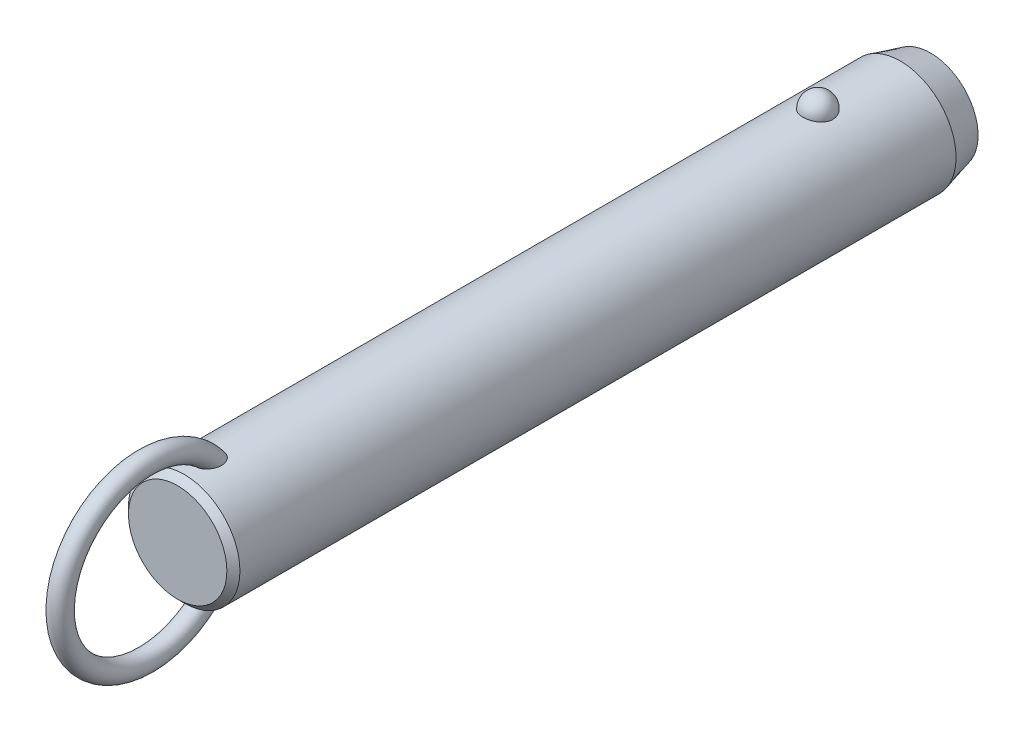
ISO-10303-21;
HEADER;
FILE_DESCRIPTION(('STEP AP214'),'2;1');
FILE_NAME('part.step','',(''),(''),'','','');
FILE_SCHEMA(('AUTOMOTIVE_DESIGN { 1 0 10303 214 1 1 1 1 }'));
ENDSEC;
DATA;
#1=APPLICATION_CONTEXT('core data for automotive mechanical design processes');
#2=APPLICATION_PROTOCOL_DEFINITION('international standard','automotive_design',2000,#1);
#3=PRODUCT_CONTEXT('',#1,'mechanical');
#4=PRODUCT('Part','Part','',(#3));
#5=PRODUCT_RELATED_PRODUCT_CATEGORY('part','',(#4));
#6=PRODUCT_DEFINITION_FORMATION('','',#4);
#7=PRODUCT_DEFINITION_CONTEXT('part definition',#1,'design');
#8=PRODUCT_DEFINITION('design','',#6,#7);
#9=PRODUCT_DEFINITION_SHAPE('','',#8);
#10=(LENGTH_UNIT() NAMED_UNIT(*) SI_UNIT(.MILLI.,.METRE.));
#11=(NAMED_UNIT(*) PLANE_ANGLE_UNIT() SI_UNIT($,.RADIAN.));
#12=(NAMED_UNIT(*) SI_UNIT($,.STERADIAN.) SOLID_ANGLE_UNIT());
#13=UNCERTAINTY_MEASURE_WITH_UNIT(LENGTH_MEASURE(1.E-05),#10,'distance_accuracy_value','');
#14=(GEOMETRIC_REPRESENTATION_CONTEXT(3) GLOBAL_UNCERTAINTY_ASSIGNED_CONTEXT((#13)) GLOBAL_UNIT_ASSIGNED_CONTEXT((#10,
#11,#12)) REPRESENTATION_CONTEXT('',''));
#15=CARTESIAN_POINT('',(0.,0.,0.));
#16=DIRECTION('',(0.,0.,1.));
#17=DIRECTION('',(1.,0.,0.));
#18=AXIS2_PLACEMENT_3D('',#15,#16,#17);
#19=CARTESIAN_POINT('',(0.,0.,111.8));
#20=DIRECTION('',(0.,0.,-1.));
#21=DIRECTION('',(-1.,0.,0.));
#22=AXIS2_PLACEMENT_3D('',#19,#20,#21);
#23=CYLINDRICAL_SURFACE('',#22,11.1);
#24=CARTESIAN_POINT('',(2.9724815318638,10.6945945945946,-3.));
#25=CARTESIAN_POINT('',(2.97247830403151,10.6945972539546,-2.83225059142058));
#26=CARTESIAN_POINT('',(2.95876598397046,10.6984356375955,-2.66445972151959));
#27=CARTESIAN_POINT('',(2.90424529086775,10.7133624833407,-2.33362381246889));
#28=CARTESIAN_POINT('',(2.8634252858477,10.7244540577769,-2.1705808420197));
#29=CARTESIAN_POINT('',(2.75573657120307,10.7526272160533,-1.85396767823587));
#30=CARTESIAN_POINT('',(2.68887937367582,10.7697061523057,-1.70039333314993));
#31=CARTESIAN_POINT('',(2.53079696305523,10.8079438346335,-1.40691598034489));
#32=CARTESIAN_POINT('',(2.43957264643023,10.8291024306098,-1.2670124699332));
#33=CARTESIAN_POINT('',(2.23458150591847,10.8732541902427,-1.00409565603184));
#34=CARTESIAN_POINT('',(2.12071295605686,10.8962553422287,-0.881162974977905));
#35=CARTESIAN_POINT('',(1.87365402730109,10.9414421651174,-0.656352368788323));
#36=CARTESIAN_POINT('',(1.74046358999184,10.9636278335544,-0.554474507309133));
#37=CARTESIAN_POINT('',(1.45872188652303,11.0046495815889,-0.374872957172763));
#38=CARTESIAN_POINT('',(1.31021276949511,11.0234944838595,-0.297085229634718));
#39=CARTESIAN_POINT('',(1.00170030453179,11.0557957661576,-0.167529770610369));
#40=CARTESIAN_POINT('',(0.841698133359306,11.0692526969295,-0.115759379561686));
#41=CARTESIAN_POINT('',(0.517607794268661,11.0890932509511,-0.0403925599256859));
#42=CARTESIAN_POINT('',(0.353633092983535,11.0955916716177,-0.0163383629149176));
#43=CARTESIAN_POINT('',(0.0238420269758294,11.1011989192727,0.0044517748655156));
#44=CARTESIAN_POINT('',(-0.141974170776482,11.1003084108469,0.00119017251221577));
#45=CARTESIAN_POINT('',(-0.468405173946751,11.0912990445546,-0.0323233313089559));
#46=CARTESIAN_POINT('',(-0.629059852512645,11.0832767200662,-0.0622147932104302));
#47=CARTESIAN_POINT('',(-0.942937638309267,11.0609962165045,-0.147645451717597));
#48=CARTESIAN_POINT('',(-1.09616062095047,11.0467379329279,-0.203185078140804));
#49=CARTESIAN_POINT('',(-1.39181061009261,11.0134071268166,-0.3387529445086));
#50=CARTESIAN_POINT('',(-1.53417383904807,10.9943086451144,-0.418913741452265));
#51=CARTESIAN_POINT('',(-1.80342160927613,10.9533667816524,-0.60144882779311));
#52=CARTESIAN_POINT('',(-1.9303046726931,10.9315231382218,-0.703825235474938));
#53=CARTESIAN_POINT('',(-2.16747598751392,10.887005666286,-0.930091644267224));
#54=CARTESIAN_POINT('',(-2.27742774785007,10.8643239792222,-1.05433291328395));
#55=CARTESIAN_POINT('',(-2.47517316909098,10.8209886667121,-1.31966633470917));
#56=CARTESIAN_POINT('',(-2.56296538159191,10.8003351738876,-1.46075958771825));
#57=CARTESIAN_POINT('',(-2.71500300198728,10.7631304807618,-1.75753646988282));
#58=CARTESIAN_POINT('',(-2.77898901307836,10.7466250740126,-1.91335887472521));
#59=CARTESIAN_POINT('',(-2.88046189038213,10.7198747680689,-2.2339152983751));
#60=CARTESIAN_POINT('',(-2.91794947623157,10.709629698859,-2.39864907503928));
#61=CARTESIAN_POINT('',(-2.96537819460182,10.6965949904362,-2.73165170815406));
#62=CARTESIAN_POINT('',(-2.97542891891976,10.693775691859,-2.89990378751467));
#63=CARTESIAN_POINT('',(-2.96804271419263,10.6958279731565,-3.235752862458));
#64=CARTESIAN_POINT('',(-2.95060646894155,10.7006993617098,-3.40334987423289));
#65=CARTESIAN_POINT('',(-2.88883358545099,10.71753912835,-3.73233906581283));
#66=CARTESIAN_POINT('',(-2.84462026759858,10.7294749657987,-3.89375610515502));
#67=CARTESIAN_POINT('',(-2.73050447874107,10.7590797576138,-4.20667949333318));
#68=CARTESIAN_POINT('',(-2.66060103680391,10.7767489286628,-4.35818546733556));
#69=CARTESIAN_POINT('',(-2.49642559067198,10.8159599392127,-4.6478542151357));
#70=CARTESIAN_POINT('',(-2.40203047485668,10.8375211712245,-4.78594458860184));
#71=CARTESIAN_POINT('',(-2.19143488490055,10.8820570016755,-5.0441038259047));
#72=CARTESIAN_POINT('',(-2.07523364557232,10.9050316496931,-5.16417205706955));
#73=CARTESIAN_POINT('',(-1.82361254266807,10.9499219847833,-5.38334833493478));
#74=CARTESIAN_POINT('',(-1.68812945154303,10.9718338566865,-5.48238464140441));
#75=CARTESIAN_POINT('',(-1.40191298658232,11.0120611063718,-5.65618873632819));
#76=CARTESIAN_POINT('',(-1.25118062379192,11.0303767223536,-5.73095813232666));
#77=CARTESIAN_POINT('',(-0.940570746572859,11.0611653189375,-5.85334725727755));
#78=CARTESIAN_POINT('',(-0.780821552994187,11.0737044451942,-5.90127578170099));
#79=CARTESIAN_POINT('',(-0.455204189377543,11.0918598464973,-5.96992976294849));
#80=CARTESIAN_POINT('',(-0.289336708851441,11.0974768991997,-5.99065827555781));
#81=CARTESIAN_POINT('',(0.0406846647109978,11.1011307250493,-6.00418773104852));
#82=CARTESIAN_POINT('',(0.204817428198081,11.099299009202,-5.99747318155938));
#83=CARTESIAN_POINT('',(0.5295530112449,11.088551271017,-5.9574031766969));
#84=CARTESIAN_POINT('',(0.69015594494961,11.0796354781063,-5.92404858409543));
#85=CARTESIAN_POINT('',(1.0027760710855,11.0557204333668,-5.83180084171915));
#86=CARTESIAN_POINT('',(1.15482001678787,11.0407414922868,-5.77299291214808));
#87=CARTESIAN_POINT('',(1.44678373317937,11.0062913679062,-5.63147366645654));
#88=CARTESIAN_POINT('',(1.58670279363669,10.9868199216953,-5.54876095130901));
#89=CARTESIAN_POINT('',(1.8527023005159,10.9451315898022,-5.36027644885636));
#90=CARTESIAN_POINT('',(1.97855158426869,10.9228788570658,-5.25418644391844));
#91=CARTESIAN_POINT('',(2.21080872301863,10.8782509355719,-5.02251354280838));
#92=CARTESIAN_POINT('',(2.31721312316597,10.8558757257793,-4.89692718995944));
#93=CARTESIAN_POINT('',(2.5094551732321,10.8130715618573,-4.62745408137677));
#94=CARTESIAN_POINT('',(2.59493284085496,10.7926798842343,-4.48330448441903));
#95=CARTESIAN_POINT('',(2.740862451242,10.7565495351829,-4.18236358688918));
#96=CARTESIAN_POINT('',(2.80132490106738,10.7408089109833,-4.02557762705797));
#97=CARTESIAN_POINT('',(2.88959070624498,10.7173718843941,-3.72475308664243));
#98=CARTESIAN_POINT('',(2.92062102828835,10.7088950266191,-3.58171216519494));
#99=CARTESIAN_POINT('',(2.96206765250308,10.6975052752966,-3.29245795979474));
#100=CARTESIAN_POINT('',(2.97248434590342,10.6945922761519,-3.14624473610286));
#101=CARTESIAN_POINT('',(2.9724815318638,10.6945945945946,-3.));
#102=B_SPLINE_CURVE_WITH_KNOTS('',3,(#24,#25,#26,#27,#28,#29,#30,#31,#32,#33,#34,#35,#36,#37,
#38,#39,#40,#41,#42,#43,#44,#45,#46,#47,#48,#49,#50,#51,#52,#53,#54,#55,#56,#57,#58,#59,#60,#61,
#62,#63,#64,#65,#66,#67,#68,#69,#70,#71,#72,#73,#74,#75,#76,#77,#78,#79,#80,#81,#82,#83,#84,#85,
#86,#87,#88,#89,#90,#91,#92,#93,#94,#95,#96,#97,#98,#99,#100,#101),.UNSPECIFIED.,.T.,.F.,(4,2,2,
2,2,2,2,2,2,2,2,2,2,2,2,2,2,2,2,2,2,2,2,2,2,2,2,2,2,2,2,2,2,2,2,2,2,2,4),(0.,0.502722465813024,
1.00566079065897,1.5083769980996,2.01107471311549,2.51608392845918,3.02109467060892,
3.52475118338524,4.02835620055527,4.523518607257,5.0186364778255,5.50715297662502,
5.9956776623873,6.48688002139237,6.97812923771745,7.47814366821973,7.9781907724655,
8.48353712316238,8.9888697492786,9.49218093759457,9.99547960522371,10.4964777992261,
10.997494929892,11.5010810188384,12.0046847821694,12.5099796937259,13.0152411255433,
13.5145635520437,14.0138298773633,14.5043200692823,14.9947943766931,15.4836390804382,
15.9725123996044,16.4685040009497,16.9645836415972,17.4686765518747,17.972557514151,
18.410841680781,18.849117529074),.UNSPECIFIED.);
#103=CARTESIAN_POINT('',(2.9724815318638,10.6945945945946,-3.));
#104=VERTEX_POINT('',#103);
#105=EDGE_CURVE('E41',#104,#104,#102,.T.);
#106=ORIENTED_EDGE('',*,*,#105,.T.);
#107=EDGE_LOOP('',(#106));
#108=FACE_BOUND('',#107,.T.);
#109=CARTESIAN_POINT('',(0.,0.,123.2));
#110=DIRECTION('',(0.,0.,1.));
#111=DIRECTION('',(1.,0.,0.));
#112=AXIS2_PLACEMENT_3D('',#109,#110,#111);
#113=CIRCLE('',#112,11.1);
#114=CARTESIAN_POINT('',(11.1,0.,123.2));
#115=VERTEX_POINT('',#114);
#116=EDGE_CURVE('E10',#115,#115,#113,.F.);
#117=ORIENTED_EDGE('',*,*,#116,.T.);
#118=EDGE_LOOP('',(#117));
#119=FACE_BOUND('',#118,.T.);
#120=CARTESIAN_POINT('',(-0.564520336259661,-11.0856356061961,115.457815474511));
#121=CARTESIAN_POINT('',(-0.667202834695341,-11.0804062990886,115.491283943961));
#122=CARTESIAN_POINT('',(-0.766875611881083,-11.0738877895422,115.533835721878));
#123=CARTESIAN_POINT('',(-0.957284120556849,-11.0590576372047,115.635419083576));
#124=CARTESIAN_POINT('',(-1.04801616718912,-11.0507452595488,115.69445742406));
#125=CARTESIAN_POINT('',(-1.21800952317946,-11.0333016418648,115.826529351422));
#126=CARTESIAN_POINT('',(-1.29730805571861,-11.0241732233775,115.899515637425));
#127=CARTESIAN_POINT('',(-1.44337665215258,-11.0060026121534,116.057037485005));
#128=CARTESIAN_POINT('',(-1.51014622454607,-10.9969604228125,116.141573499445));
#129=CARTESIAN_POINT('',(-1.63454620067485,-10.9791841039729,116.325521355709));
#130=CARTESIAN_POINT('',(-1.69127003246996,-10.9705107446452,116.425549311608));
#131=CARTESIAN_POINT('',(-1.78980785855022,-10.9548648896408,116.632790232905));
#132=CARTESIAN_POINT('',(-1.83161214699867,-10.9478935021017,116.740007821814));
#133=CARTESIAN_POINT('',(-1.91557028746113,-10.9335803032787,117.005408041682));
#134=CARTESIAN_POINT('',(-1.95040620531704,-10.9273269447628,117.165980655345));
#135=CARTESIAN_POINT('',(-1.99388326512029,-10.9194709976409,117.490697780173));
#136=CARTESIAN_POINT('',(-2.00248051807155,-10.9178762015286,117.654847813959));
#137=CARTESIAN_POINT('',(-1.99551615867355,-10.9191578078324,118.024650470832));
#138=CARTESIAN_POINT('',(-1.9732206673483,-10.9232807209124,118.230191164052));
#139=CARTESIAN_POINT('',(-1.9152976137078,-10.9335244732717,118.533595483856));
#140=CARTESIAN_POINT('',(-1.8918457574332,-10.9376266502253,118.634088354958));
#141=CARTESIAN_POINT('',(-1.83700674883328,-10.9469720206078,118.832855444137));
#142=CARTESIAN_POINT('',(-1.80562070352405,-10.9522150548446,118.931129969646));
#143=CARTESIAN_POINT('',(-1.73463055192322,-10.9636837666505,119.125914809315));
#144=CARTESIAN_POINT('',(-1.6949341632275,-10.9699202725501,119.222390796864));
#145=CARTESIAN_POINT('',(-1.6074514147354,-10.9830806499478,119.411626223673));
#146=CARTESIAN_POINT('',(-1.55966150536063,-10.9900048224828,119.504384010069));
#147=CARTESIAN_POINT('',(-1.45591812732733,-11.0042280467,119.684690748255));
#148=CARTESIAN_POINT('',(-1.40000013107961,-11.0115253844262,119.772260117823));
#149=CARTESIAN_POINT('',(-1.27937470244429,-11.0261911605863,119.941029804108));
#150=CARTESIAN_POINT('',(-1.2146783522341,-11.0335594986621,120.02223795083));
#151=CARTESIAN_POINT('',(-1.08218150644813,-11.0473027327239,120.169001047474));
#152=CARTESIAN_POINT('',(-1.0152263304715,-11.0537063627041,120.235309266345));
#153=CARTESIAN_POINT('',(-0.872952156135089,-11.065850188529,120.358378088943));
#154=CARTESIAN_POINT('',(-0.797642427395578,-11.0715911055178,120.415149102));
#155=CARTESIAN_POINT('',(-0.651396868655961,-11.081071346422,120.507515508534));
#156=CARTESIAN_POINT('',(-0.581712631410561,-11.0849841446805,120.545049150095));
#157=CARTESIAN_POINT('',(-0.437066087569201,-11.0916271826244,120.608259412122));
#158=CARTESIAN_POINT('',(-0.362109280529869,-11.0943586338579,120.633948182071));
#159=CARTESIAN_POINT('',(-0.207828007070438,-11.0983242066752,120.671117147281));
#160=CARTESIAN_POINT('',(-0.128467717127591,-11.0995432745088,120.682454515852));
#161=CARTESIAN_POINT('',(0.0309101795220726,-11.1002423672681,120.688965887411));
#162=CARTESIAN_POINT('',(0.110927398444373,-11.0997233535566,120.684148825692));
#163=CARTESIAN_POINT('',(0.256406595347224,-11.097240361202,120.660959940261));
#164=CARTESIAN_POINT('',(0.322235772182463,-11.0955074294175,120.644754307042));
#165=CARTESIAN_POINT('',(0.450635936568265,-11.0910350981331,120.602600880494));
#166=CARTESIAN_POINT('',(0.513205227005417,-11.0882951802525,120.576648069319));
#167=CARTESIAN_POINT('',(0.6626263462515,-11.0805620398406,120.502607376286));
#168=CARTESIAN_POINT('',(0.74712753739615,-11.0751144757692,120.449845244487));
#169=CARTESIAN_POINT('',(0.906756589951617,-11.0631932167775,120.331720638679));
#170=CARTESIAN_POINT('',(0.981859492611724,-11.0567168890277,120.266325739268));
#171=CARTESIAN_POINT('',(1.10712207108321,-11.0447856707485,120.14226337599));
#172=CARTESIAN_POINT('',(1.15909566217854,-11.0394280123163,120.085383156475));
#173=CARTESIAN_POINT('',(1.25791923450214,-11.0286040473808,119.967327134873));
#174=CARTESIAN_POINT('',(1.30476642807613,-11.0231376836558,119.906149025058));
#175=CARTESIAN_POINT('',(1.43818612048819,-11.0068027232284,119.717305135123));
#176=CARTESIAN_POINT('',(1.51751767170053,-10.9960104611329,119.584453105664));
#177=CARTESIAN_POINT('',(1.63597546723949,-10.9788847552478,119.353137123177));
#178=CARTESIAN_POINT('',(1.67988876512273,-10.9722190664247,119.257053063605));
#179=CARTESIAN_POINT('',(1.75953241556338,-10.9597298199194,119.061431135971));
#180=CARTESIAN_POINT('',(1.79525967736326,-10.9539065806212,118.961891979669));
#181=CARTESIAN_POINT('',(1.85844731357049,-10.9433632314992,118.76021118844));
#182=CARTESIAN_POINT('',(1.88591073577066,-10.9386427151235,118.658070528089));
#183=CARTESIAN_POINT('',(1.93234324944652,-10.9305350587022,118.451819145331));
#184=CARTESIAN_POINT('',(1.95131065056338,-10.9271481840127,118.347708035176));
#185=CARTESIAN_POINT('',(1.99040203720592,-10.9201183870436,118.065458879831));
#186=CARTESIAN_POINT('',(2.00221217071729,-10.9179256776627,117.886037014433));
#187=CARTESIAN_POINT('',(1.99711676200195,-10.9188636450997,117.527713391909));
#188=CARTESIAN_POINT('',(1.98026150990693,-10.9219849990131,117.348811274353));
#189=CARTESIAN_POINT('',(1.92151657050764,-10.9324473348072,117.03645144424));
#190=CARTESIAN_POINT('',(1.88605081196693,-10.9386915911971,116.901759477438));
#191=CARTESIAN_POINT('',(1.79393020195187,-10.9541780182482,116.639966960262));
#192=CARTESIAN_POINT('',(1.73729868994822,-10.9634168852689,116.512858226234));
#193=CARTESIAN_POINT('',(1.61237037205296,-10.9824218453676,116.289418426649));
#194=CARTESIAN_POINT('',(1.54715374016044,-10.9918945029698,116.191345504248));
#195=CARTESIAN_POINT('',(1.40127026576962,-11.0114415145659,116.007434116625));
#196=CARTESIAN_POINT('',(1.3206074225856,-11.0215157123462,115.921592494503));
#197=CARTESIAN_POINT('',(1.14474787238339,-11.041168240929,115.765163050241));
#198=CARTESIAN_POINT('',(1.04947805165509,-11.0507437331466,115.694656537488));
#199=CARTESIAN_POINT('',(0.847278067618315,-11.0680789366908,115.572640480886));
#200=CARTESIAN_POINT('',(0.740351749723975,-11.0758392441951,115.521124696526));
#201=CARTESIAN_POINT('',(0.529289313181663,-11.0878275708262,115.443485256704));
#202=CARTESIAN_POINT('',(0.425895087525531,-11.0923259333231,115.415377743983));
#203=CARTESIAN_POINT('',(0.215723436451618,-11.0984001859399,115.377703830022));
#204=CARTESIAN_POINT('',(0.108947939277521,-11.0999777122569,115.368127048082));
#205=CARTESIAN_POINT('',(-0.0938962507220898,-11.1000196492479,115.367877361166));
#206=CARTESIAN_POINT('',(-0.189967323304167,-11.0987797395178,115.375408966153));
#207=CARTESIAN_POINT('',(-0.379657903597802,-11.0939111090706,115.405507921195));
#208=CARTESIAN_POINT('',(-0.473277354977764,-11.0902823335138,115.428075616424));
#209=CARTESIAN_POINT('',(-0.564520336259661,-11.0856356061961,115.457815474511));
#210=B_SPLINE_CURVE_WITH_KNOTS('',3,(#120,#121,#122,#123,#124,#125,#126,#127,#128,#129,#130,
#131,#132,#133,#134,#135,#136,#137,#138,#139,#140,#141,#142,#143,#144,#145,#146,#147,#148,#149,
#150,#151,#152,#153,#154,#155,#156,#157,#158,#159,#160,#161,#162,#163,#164,#165,#166,#167,#168,
#169,#170,#171,#172,#173,#174,#175,#176,#177,#178,#179,#180,#181,#182,#183,#184,#185,#186,#187,
#188,#189,#190,#191,#192,#193,#194,#195,#196,#197,#198,#199,#200,#201,#202,#203,#204,#205,#206,
#207,#208,#209),.UNSPECIFIED.,.T.,.F.,(4,2,2,2,2,2,2,2,2,2,2,2,2,2,2,2,2,2,2,2,2,2,2,2,2,2,2,2,
2,2,2,2,2,2,2,2,2,2,2,2,2,2,2,2,4),(0.,0.323999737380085,0.648132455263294,0.971184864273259,
1.2942499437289,1.6388623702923,1.98369857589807,2.47426059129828,2.96564271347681,
3.58257396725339,3.89215258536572,4.201688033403,4.51486273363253,4.82817514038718,
5.14015911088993,5.45175282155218,5.73442856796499,6.01679375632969,6.25364580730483,
6.49025437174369,6.72919963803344,6.96801276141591,7.17061258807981,7.37331685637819,
7.67094989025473,7.9693572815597,8.2007506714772,8.43226927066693,8.89581623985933,
9.21306533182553,9.5304340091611,9.84768549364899,10.1650000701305,10.7022930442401,
11.2386443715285,11.6553390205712,12.0715755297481,12.4245637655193,12.7774607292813,
13.1321855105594,13.4867936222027,13.8068771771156,14.1267813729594,14.4146787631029,
14.7025827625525),.UNSPECIFIED.);
#211=CARTESIAN_POINT('',(-0.564520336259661,-11.0856356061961,115.457815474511));
#212=VERTEX_POINT('',#211);
#213=EDGE_CURVE('E59',#212,#212,#210,.T.);
#214=ORIENTED_EDGE('',*,*,#213,.T.);
#215=EDGE_LOOP('',(#214));
#216=FACE_BOUND('',#215,.T.);
#217=CARTESIAN_POINT('',(-0.564520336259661,11.0856356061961,115.457815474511));
#218=CARTESIAN_POINT('',(-0.468542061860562,11.0905203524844,115.426545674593));
#219=CARTESIAN_POINT('',(-0.36979381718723,11.0942886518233,115.403157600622));
#220=CARTESIAN_POINT('',(-0.169555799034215,11.0991586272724,115.373085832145));
#221=CARTESIAN_POINT('',(-0.0680604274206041,11.1002543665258,115.36643932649));
#222=CARTESIAN_POINT('',(0.134549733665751,11.099646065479,115.370157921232));
#223=CARTESIAN_POINT('',(0.235664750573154,11.0979441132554,115.38051033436));
#224=CARTESIAN_POINT('',(0.434632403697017,11.0919342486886,115.417831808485));
#225=CARTESIAN_POINT('',(0.532486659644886,11.0876276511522,115.444792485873));
#226=CARTESIAN_POINT('',(0.722445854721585,11.0768742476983,115.5144096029));
#227=CARTESIAN_POINT('',(0.814543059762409,11.0704246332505,115.557086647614));
#228=CARTESIAN_POINT('',(0.99056508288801,11.0560659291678,115.656648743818));
#229=CARTESIAN_POINT('',(1.07448844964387,11.048156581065,115.713536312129));
#230=CARTESIAN_POINT('',(1.23562672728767,11.0313221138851,115.842210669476));
#231=CARTESIAN_POINT('',(1.3124268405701,11.0223686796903,115.914511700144));
#232=CARTESIAN_POINT('',(1.45398030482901,11.0045918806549,116.070042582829));
#233=CARTESIAN_POINT('',(1.5187307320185,10.9957685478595,116.153275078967));
#234=CARTESIAN_POINT('',(1.64107232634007,10.9782087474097,116.336384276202));
#235=CARTESIAN_POINT('',(1.69743176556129,10.9695572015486,116.437089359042));
#236=CARTESIAN_POINT('',(1.79515063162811,10.9539887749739,116.645626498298));
#237=CARTESIAN_POINT('',(1.83649966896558,10.9470730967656,116.75346343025));
#238=CARTESIAN_POINT('',(1.91931148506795,10.9329211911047,117.020399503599));
#239=CARTESIAN_POINT('',(1.95340104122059,10.9267904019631,117.181861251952));
#240=CARTESIAN_POINT('',(1.99526195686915,10.9192174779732,117.50821631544));
#241=CARTESIAN_POINT('',(2.00298989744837,10.9177830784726,117.67311484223));
#242=CARTESIAN_POINT('',(1.9939625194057,10.9194420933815,118.044100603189));
#243=CARTESIAN_POINT('',(1.97050829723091,10.923774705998,118.25003871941));
#244=CARTESIAN_POINT('',(1.91079643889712,10.9343131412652,118.553901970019));
#245=CARTESIAN_POINT('',(1.88673702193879,10.9385106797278,118.654529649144));
#246=CARTESIAN_POINT('',(1.83065508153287,10.9480376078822,118.853510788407));
#247=CARTESIAN_POINT('',(1.79863369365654,10.9533668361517,118.951864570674));
#248=CARTESIAN_POINT('',(1.72633365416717,10.9649954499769,119.146720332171));
#249=CARTESIAN_POINT('',(1.68596409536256,10.9713053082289,119.24318790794));
#250=CARTESIAN_POINT('',(1.5970799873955,10.9845964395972,119.432323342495));
#251=CARTESIAN_POINT('',(1.54856169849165,10.9915780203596,119.524989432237));
#252=CARTESIAN_POINT('',(1.44330168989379,11.0058935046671,119.704975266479));
#253=CARTESIAN_POINT('',(1.38659749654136,11.0132257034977,119.792316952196));
#254=CARTESIAN_POINT('',(1.26431158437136,11.0279330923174,119.960456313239));
#255=CARTESIAN_POINT('',(1.19874160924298,11.0353082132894,120.041262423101));
#256=CARTESIAN_POINT('',(1.06542088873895,11.048931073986,120.185985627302));
#257=CARTESIAN_POINT('',(0.998640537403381,11.0552153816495,120.250784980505));
#258=CARTESIAN_POINT('',(0.856896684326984,11.0671032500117,120.370846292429));
#259=CARTESIAN_POINT('',(0.781942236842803,11.0727075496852,120.426118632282));
#260=CARTESIAN_POINT('',(0.636276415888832,11.081949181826,120.515972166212));
#261=CARTESIAN_POINT('',(0.566755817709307,11.0857572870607,120.552441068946));
#262=CARTESIAN_POINT('',(0.422602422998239,11.0921860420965,120.613533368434));
#263=CARTESIAN_POINT('',(0.347974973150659,11.0948079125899,120.638168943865));
#264=CARTESIAN_POINT('',(0.19459385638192,11.0985608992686,120.673323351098));
#265=CARTESIAN_POINT('',(0.115807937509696,11.0996777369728,120.683706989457));
#266=CARTESIAN_POINT('',(-0.0422499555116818,11.1002003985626,120.688574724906));
#267=CARTESIAN_POINT('',(-0.121521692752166,11.09960699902,120.683066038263));
#268=CARTESIAN_POINT('',(-0.266046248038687,11.0970123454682,120.658827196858));
#269=CARTESIAN_POINT('',(-0.331661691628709,11.0952283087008,120.642135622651));
#270=CARTESIAN_POINT('',(-0.459588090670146,11.0906663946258,120.599111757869));
#271=CARTESIAN_POINT('',(-0.521897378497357,11.0878880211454,120.572774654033));
#272=CARTESIAN_POINT('',(-0.671446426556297,11.0800342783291,120.497513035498));
#273=CARTESIAN_POINT('',(-0.756250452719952,11.0744969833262,120.443818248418));
#274=CARTESIAN_POINT('',(-0.916349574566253,11.0624045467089,120.323802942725));
#275=CARTESIAN_POINT('',(-0.991618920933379,11.0558467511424,120.257449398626));
#276=CARTESIAN_POINT('',(-1.11713140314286,11.0437783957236,120.131633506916));
#277=CARTESIAN_POINT('',(-1.16920539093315,11.0383619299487,120.073952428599));
#278=CARTESIAN_POINT('',(-1.26817476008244,11.02743010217,119.954280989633));
#279=CARTESIAN_POINT('',(-1.31506731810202,11.0219146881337,119.892288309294));
#280=CARTESIAN_POINT('',(-1.40399813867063,11.0109399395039,119.764784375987));
#281=CARTESIAN_POINT('',(-1.4460286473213,11.0054807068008,119.699267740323));
#282=CARTESIAN_POINT('',(-1.52538779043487,10.9947621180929,119.565422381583));
#283=CARTESIAN_POINT('',(-1.56271516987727,10.9895028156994,119.497092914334));
#284=CARTESIAN_POINT('',(-1.64537943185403,10.9774790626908,119.333210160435));
#285=CARTESIAN_POINT('',(-1.68879497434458,10.9708503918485,119.2366735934));
#286=CARTESIAN_POINT('',(-1.76740738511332,10.9584602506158,119.040236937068));
#287=CARTESIAN_POINT('',(-1.80260120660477,10.95269910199,118.94033561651));
#288=CARTESIAN_POINT('',(-1.86468657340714,10.9423003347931,118.737966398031));
#289=CARTESIAN_POINT('',(-1.89158164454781,10.9376622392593,118.635499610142));
#290=CARTESIAN_POINT('',(-1.93682458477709,10.9297405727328,118.428642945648));
#291=CARTESIAN_POINT('',(-1.9551708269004,10.9264572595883,118.324252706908));
#292=CARTESIAN_POINT('',(-1.99232562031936,10.9197647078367,118.04262876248));
#293=CARTESIAN_POINT('',(-2.00294603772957,10.9177914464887,117.864185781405));
#294=CARTESIAN_POINT('',(-1.99566675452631,10.9191290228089,117.507996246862));
#295=CARTESIAN_POINT('',(-1.97781651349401,10.9224306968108,117.33024902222));
#296=CARTESIAN_POINT('',(-1.91747214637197,10.93315926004,117.019792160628));
#297=CARTESIAN_POINT('',(-1.88131022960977,10.9395108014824,116.885825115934));
#298=CARTESIAN_POINT('',(-1.7879038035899,10.9551659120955,116.62559757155));
#299=CARTESIAN_POINT('',(-1.73068309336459,10.9644661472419,116.499328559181));
#300=CARTESIAN_POINT('',(-1.60475573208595,10.9835398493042,116.27741565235));
#301=CARTESIAN_POINT('',(-1.53908879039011,10.9930297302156,116.180026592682));
#302=CARTESIAN_POINT('',(-1.39238608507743,11.0125708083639,115.997525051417));
#303=CARTESIAN_POINT('',(-1.31135150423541,11.0226219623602,115.912411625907));
#304=CARTESIAN_POINT('',(-1.14382035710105,11.0411991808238,115.76529943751));
#305=CARTESIAN_POINT('',(-1.05858500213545,11.0497792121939,115.70186930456));
#306=CARTESIAN_POINT('',(-0.878723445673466,11.0655285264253,115.590250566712));
#307=CARTESIAN_POINT('',(-0.784123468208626,11.0727015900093,115.542020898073));
#308=CARTESIAN_POINT('',(-0.646163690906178,11.0812501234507,115.486023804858));
#309=CARTESIAN_POINT('',(-0.605595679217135,11.0835451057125,115.471197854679));
#310=CARTESIAN_POINT('',(-0.564520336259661,11.0856356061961,115.457815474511));
#311=B_SPLINE_CURVE_WITH_KNOTS('',3,(#217,#218,#219,#220,#221,#222,#223,#224,#225,#226,#227,
#228,#229,#230,#231,#232,#233,#234,#235,#236,#237,#238,#239,#240,#241,#242,#243,#244,#245,#246,
#247,#248,#249,#250,#251,#252,#253,#254,#255,#256,#257,#258,#259,#260,#261,#262,#263,#264,#265,
#266,#267,#268,#269,#270,#271,#272,#273,#274,#275,#276,#277,#278,#279,#280,#281,#282,#283,#284,
#285,#286,#287,#288,#289,#290,#291,#292,#293,#294,#295,#296,#297,#298,#299,#300,#301,#302,#303,
#304,#305,#306,#307,#308,#309,#310),.UNSPECIFIED.,.T.,.F.,(4,2,2,2,2,2,2,2,2,2,2,2,2,2,2,2,2,2,
2,2,2,2,2,2,2,2,2,2,2,2,2,2,2,2,2,2,2,2,2,2,2,2,2,2,2,2,4),(0.,0.303061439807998,
0.606795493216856,0.910302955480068,1.21365733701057,1.51741085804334,1.82121821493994,
2.13745205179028,2.45376252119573,2.79958678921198,3.14564996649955,3.6383239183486,
4.13180893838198,4.75031912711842,5.06071926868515,5.37107516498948,5.68500772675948,
5.99908475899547,6.31176519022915,6.62403542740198,6.90315673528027,7.1819719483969,
7.41687778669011,7.65154134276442,7.88841587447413,8.12518286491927,8.32752842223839,
8.52997509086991,8.82986421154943,9.13054668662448,9.36393502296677,9.59744991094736,
9.83133221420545,10.0652767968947,10.383032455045,10.7009056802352,11.0186436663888,
11.3364420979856,11.8705925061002,12.4038159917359,12.8189662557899,13.2336487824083,
13.5857049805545,13.9377340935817,14.2561354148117,14.5736690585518,14.7033687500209),.UNSPECIFIED.);
#312=CARTESIAN_POINT('',(-0.564520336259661,11.0856356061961,115.457815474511));
#313=VERTEX_POINT('',#312);
#314=EDGE_CURVE('E67',#313,#313,#311,.T.);
#315=ORIENTED_EDGE('',*,*,#314,.T.);
#316=EDGE_LOOP('',(#315));
#317=FACE_BOUND('',#316,.T.);
#318=CARTESIAN_POINT('',(0.,0.,-19.3999999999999));
#319=DIRECTION('',(0.,0.,-1.));
#320=DIRECTION('',(-1.,0.,0.));
#321=AXIS2_PLACEMENT_3D('',#318,#319,#320);
#322=CIRCLE('',#321,11.1);
#323=CARTESIAN_POINT('',(-11.1,0.,-19.3999999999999));
#324=VERTEX_POINT('',#323);
#325=EDGE_CURVE('E56',#324,#324,#322,.F.);
#326=ORIENTED_EDGE('',*,*,#325,.T.);
#327=EDGE_LOOP('',(#326));
#328=FACE_BOUND('',#327,.T.);
#329=ADVANCED_FACE('F37',(#108,#119,#216,#317,#328),#23,.T.);
#330=CARTESIAN_POINT('',(0.,0.,-25.4));
#331=DIRECTION('',(0.,0.,-1.));
#332=DIRECTION('',(-1.,0.,0.));
#333=AXIS2_PLACEMENT_3D('',#330,#331,#332);
#334=PLANE('',#333);
#335=CARTESIAN_POINT('',(0.,0.,-25.4));
#336=DIRECTION('',(0.,0.,-1.));
#337=DIRECTION('',(-1.,0.,0.));
#338=AXIS2_PLACEMENT_3D('',#335,#336,#337);
#339=CIRCLE('',#338,9.49230484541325);
#340=CARTESIAN_POINT('',(-9.49230484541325,0.,-25.4));
#341=VERTEX_POINT('',#340);
#342=EDGE_CURVE('E66',#341,#341,#339,.T.);
#343=ORIENTED_EDGE('',*,*,#342,.T.);
#344=EDGE_LOOP('',(#343));
#345=FACE_BOUND('',#344,.T.);
#346=ADVANCED_FACE('F85',(#345),#334,.T.);
#347=CARTESIAN_POINT('',(0.,0.,-25.4));
#348=DIRECTION('',(0.,0.,1.));
#349=DIRECTION('',(1.,0.,0.));
#350=AXIS2_PLACEMENT_3D('',#347,#348,#349);
#351=CONICAL_SURFACE('',#350,9.49230484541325,0.261799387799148);
#352=ORIENTED_EDGE('',*,*,#325,.F.);
#353=EDGE_LOOP('',(#352));
#354=FACE_BOUND('',#353,.T.);
#355=ORIENTED_EDGE('',*,*,#342,.F.);
#356=EDGE_LOOP('',(#355));
#357=FACE_BOUND('',#356,.T.);
#358=ADVANCED_FACE('F83',(#354,#357),#351,.T.);
#359=CARTESIAN_POINT('',(0.,0.,124.5));
#360=DIRECTION('',(0.,0.,1.));
#361=DIRECTION('',(1.,0.,0.));
#362=AXIS2_PLACEMENT_3D('',#359,#360,#361);
#363=PLANE('',#362);
#364=CARTESIAN_POINT('',(0.,0.,124.5));
#365=DIRECTION('',(0.,0.,1.));
#366=DIRECTION('',(1.,0.,0.));
#367=AXIS2_PLACEMENT_3D('',#364,#365,#366);
#368=CIRCLE('',#367,9.8);
#369=CARTESIAN_POINT('',(9.8,0.,124.5));
#370=VERTEX_POINT('',#369);
#371=EDGE_CURVE('E50',#370,#370,#368,.T.);
#372=ORIENTED_EDGE('',*,*,#371,.T.);
#373=EDGE_LOOP('',(#372));
#374=FACE_BOUND('',#373,.T.);
#375=ADVANCED_FACE('F77',(#374),#363,.T.);
#376=CARTESIAN_POINT('',(0.,0.,130.85));
#377=DIRECTION('',(1.,0.,0.));
#378=DIRECTION('',(0.,0.,-1.));
#379=AXIS2_PLACEMENT_3D('',#376,#377,#378);
#380=TOROIDAL_SURFACE('',#379,17.05,2.);
#381=ORIENTED_EDGE('',*,*,#314,.F.);
#382=EDGE_LOOP('',(#381));
#383=FACE_BOUND('',#382,.T.);
#384=ORIENTED_EDGE('',*,*,#213,.F.);
#385=EDGE_LOOP('',(#384));
#386=FACE_BOUND('',#385,.T.);
#387=ADVANCED_FACE('F73',(#383,#386),#380,.T.);
#388=CARTESIAN_POINT('',(0.,0.,124.5));
#389=DIRECTION('',(0.,0.,-1.));
#390=DIRECTION('',(-1.,0.,0.));
#391=AXIS2_PLACEMENT_3D('',#388,#389,#390);
#392=CONICAL_SURFACE('',#391,9.8,0.785398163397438);
#393=ORIENTED_EDGE('',*,*,#116,.F.);
#394=EDGE_LOOP('',(#393));
#395=FACE_BOUND('',#394,.T.);
#396=ORIENTED_EDGE('',*,*,#371,.F.);
#397=EDGE_LOOP('',(#396));
#398=FACE_BOUND('',#397,.T.);
#399=ADVANCED_FACE('F39',(#395,#398),#392,.T.);
#400=CARTESIAN_POINT('',(0.,11.1,-3.));
#401=DIRECTION('',(0.,1.,0.));
#402=DIRECTION('',(0.,0.,-1.));
#403=AXIS2_PLACEMENT_3D('',#400,#401,#402);
#404=SPHERICAL_SURFACE('',#403,3.);
#405=ORIENTED_EDGE('',*,*,#105,.F.);
#406=EDGE_LOOP('',(#405));
#407=FACE_BOUND('',#406,.T.);
#408=ADVANCED_FACE('F79',(#407),#404,.T.);
#409=CLOSED_SHELL('',(#329,#346,#358,#375,#387,#399,#408));
#410=MANIFOLD_SOLID_BREP('B2',#409);
#411=ADVANCED_BREP_SHAPE_REPRESENTATION('',(#18,#410),#14);
#412=SHAPE_DEFINITION_REPRESENTATION(#9,#411);
ENDSEC;
END-ISO-10303-21;
